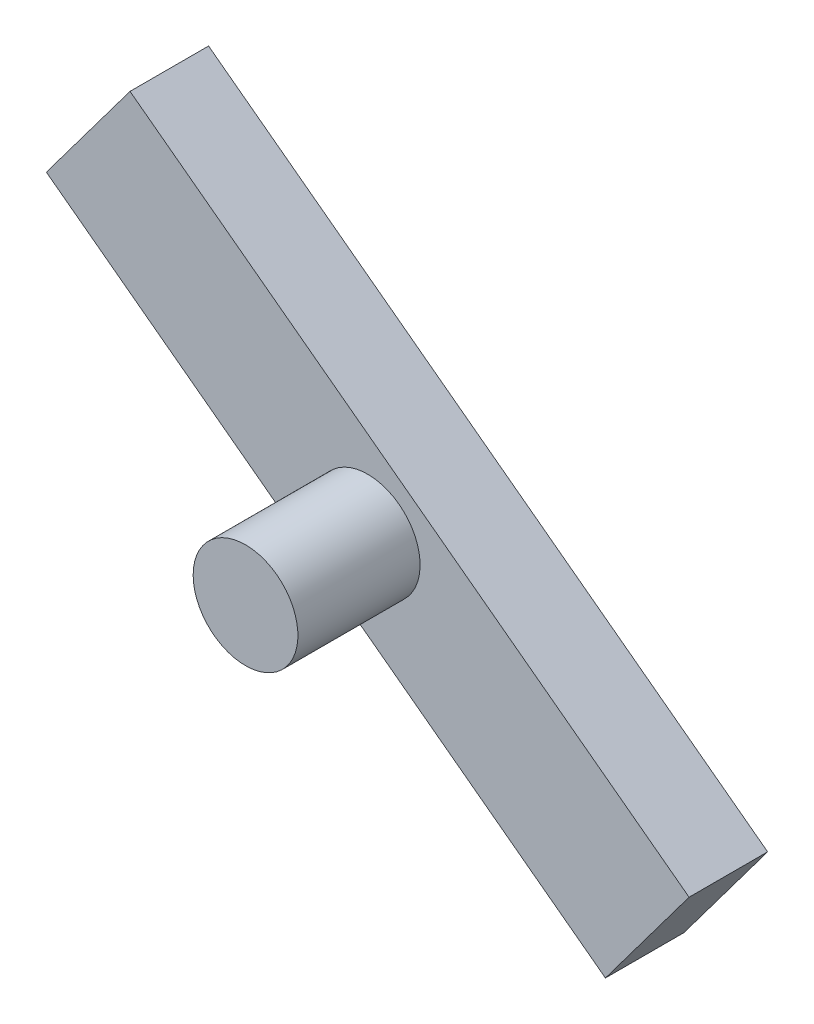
from build123d import *

# Parameters (mm, degrees)
VASTAGO_PROFILE_R = 3
GOMA_START        = 10.5
GOMA_DEPTH        = 4.5


with BuildPart() as part:
    # Vastago: sweep along a curve in space
    with BuildLine() as vastago_path:
        Line((-263.128358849, 316.504901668, 22), (-263.128358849, 316.504901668, 15))
    # Vastago profile (on start of the path) → Vastago (sweep)
    with BuildSketch(Plane(origin=(-263.128358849, 316.504901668, 22), x_dir=(-1, 0, 0), z_dir=(0, 0, -1))):
        Circle(VASTAGO_PROFILE_R)
    sweep(path=vastago_path.line)

    # Sk_Goma → Goma (add)
    with BuildSketch(Plane.XY.offset(GOMA_START)):
        Polygon((-249.511779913, 301.319751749), (-244.718766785, 307.724985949), (-276.744937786, 331.690051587), (-281.537950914, 325.284817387), align=None)
    extrude(amount=GOMA_DEPTH)


solid = part.part
